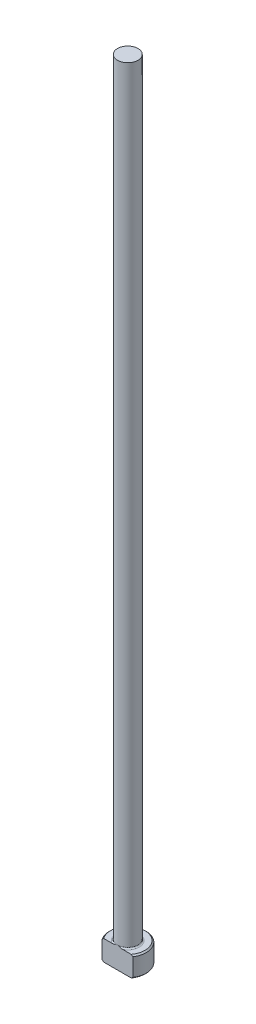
from build123d import *

# Parameters (mm, degrees)
CHAMFER1_SIZE = 0.254
FILLET1_R     = 0.254
KEY_DEPTH     = 153.483544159


with BuildPart() as part:
    # Sketch1 → Revolve1 (revolve)
    with BuildSketch(Plane.XY, mode=Mode.PRIVATE) as revolve1_sk:
        Polygon((0, 0), (-3.5687, 0), (-3.5687, 3.9624), (-1.98374, 3.9624), (-1.98374, 152.4), (0, 152.4), align=None)
    revolve(revolve1_sk.sketch.rotate(Axis((0, 259.958771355, 0), (0, -1, 0)), 270), axis=Axis((0, 259.958771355, 0), (0, -1, 0)))

    # Chamfer1
    chamfer1_edges = [part.edges().sort_by_distance(p)[0] for p in [
        (0, 3.9624, -3.5687),
        (0, 0, -3.5687),
    ]]
    chamfer(chamfer1_edges, length=CHAMFER1_SIZE)

    # Fillet1
    fillet1_edges = [part.edges().sort_by_distance(p)[0] for p in [
        (0, 3.9624, -1.98374),
    ]]
    fillet(fillet1_edges, radius=FILLET1_R)

    # Sketch2 → KEY (cut, through all)
    with BuildSketch(Plane.XZ):
        with BuildLine():
            Line((-2.966546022, 1.98374), (2.966546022, 1.98374))
            ThreePointArc((2.966546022, 1.98374), (0, 3.5687), (-2.966546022, 1.98374))
        make_face()
    extrude(amount=-KEY_DEPTH, mode=Mode.SUBTRACT)


solid = part.part
